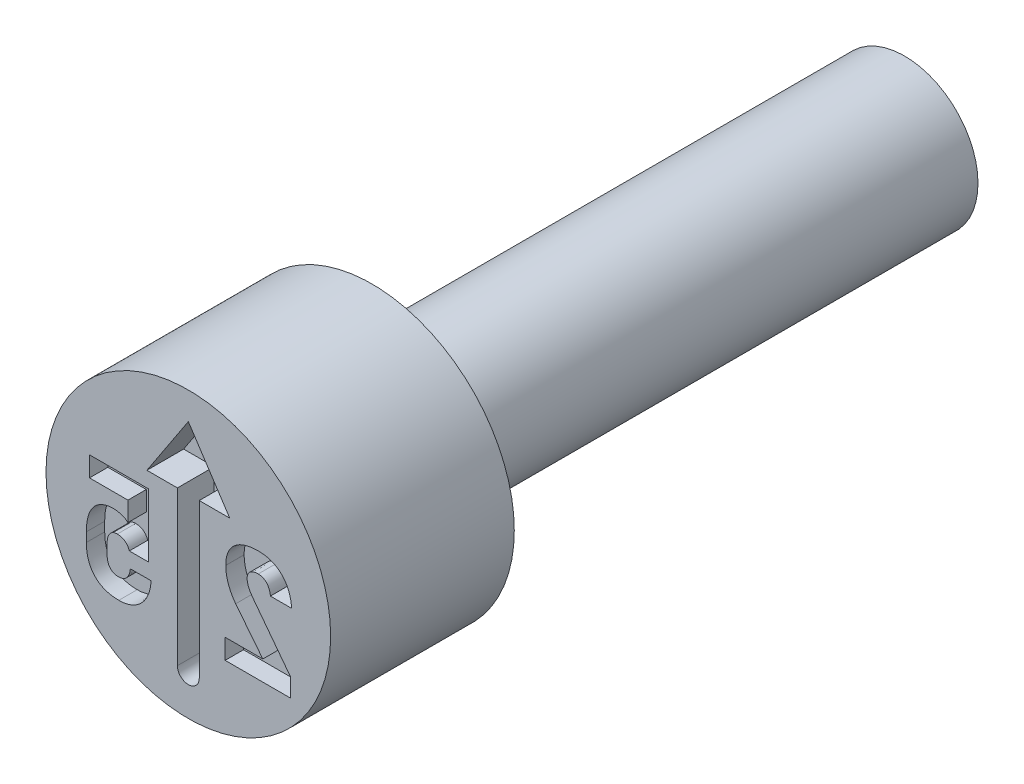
from build123d import *

# Parameters (mm, degrees)
CUT_EXTRUDE4_DEPTH = 0.4
CUT_EXTRUDE5_DEPTH = 0.2


with BuildPart() as part:
    # Sketch2 → Revolve1 (revolve)
    with BuildSketch(Plane(origin=(0, 0, 0), x_dir=(0, 0, -1), z_dir=(1, 0, 0)), mode=Mode.PRIVATE) as revolve1_sk:
        Polygon((0, 1.55), (0, 0), (7.8, 0), (7.8, 0.8), (2, 0.8), (2, 1.55), align=None)
    revolve(revolve1_sk.sketch.rotate(Axis((0, 0, -0.403888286), (0, 0, -1)), 90), axis=Axis((0, 0, -0.403888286), (0, 0, -1)))

    # Sketch3 → Cut-Extrude4 (cut)
    with BuildSketch(Plane.XY):
        with BuildLine():
            Line((0.119045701, 0.566469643), (0.119045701, -1.110101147))
            ThreePointArc((0.119045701, -1.110101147), (0, -1.229146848), (-0.119045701, -1.110101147))
            Line((-0.119045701, -1.110101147), (-0.119045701, 0.566469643))
            Line((-0.119045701, 0.566469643), (-0.451198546, 0.566469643))
            Line((-0.451198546, 0.566469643), (0, 1.251322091))
            Line((0, 1.251322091), (0.451198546, 0.566469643))
            Line((0.451198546, 0.566469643), (0.119045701, 0.566469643))
        make_face()
    extrude(amount=-CUT_EXTRUDE4_DEPTH, mode=Mode.SUBTRACT)

    # Sketch4 → Cut-Extrude5 (cut)
    with BuildSketch(Plane.XY):
        with BuildLine():
            Line((1.11073976, -0.596046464), (0.69891991, -0.054615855))
            add(Edge.make_bspline(
                [(0.69891991, -0.054615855), (0.69028293, -0.042632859), (0.673421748, -0.019239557), (0.6583362, 0.013026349), (0.648752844, 0.038326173), (0.644322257, 0.056678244), (0.641042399, 0.074226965), (0.640660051, 0.085740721), (0.640472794, 0.091379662)],
                knots=[0, 0, 0, 0, 1.660423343, 3.241491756, 3.993801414, 4.704207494, 5.365376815, 6, 6, 6, 6], degree=3))
            Line((0.640472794, 0.091379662), (0.640472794, 0.093091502))
            add(Edge.make_bspline(
                [(0.640472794, 0.093091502), (0.640800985, 0.100797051), (0.641426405, 0.115481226), (0.647464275, 0.136140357), (0.657448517, 0.15400486), (0.671433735, 0.168980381), (0.689223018, 0.18048976), (0.710206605, 0.188897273), (0.734496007, 0.193654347), (0.751721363, 0.194260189), (0.760790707, 0.194579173)],
                knots=[0, 0, 0, 0, 1.033361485, 1.969238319, 2.861873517, 3.760870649, 4.693536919, 5.686153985, 6.781734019, 8, 8, 8, 8], degree=3))
            add(Edge.make_bspline(
                [(0.760790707, 0.194579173), (0.769721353, 0.194201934), (0.787052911, 0.193469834), (0.811707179, 0.186493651), (0.8336084, 0.174650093), (0.85256745, 0.158282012), (0.868475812, 0.137690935), (0.880201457, 0.112885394), (0.889644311, 0.08469284), (0.892384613, 0.064231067), (0.893825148, 0.053474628)],
                knots=[0, 0, 0, 0, 0.993701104, 1.928459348, 2.826878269, 3.748294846, 4.700551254, 5.70417143, 6.793118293, 8, 8, 8, 8], degree=3))
            Line((0.893825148, 0.053474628), (1.125657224, 0.052496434))
            add(Edge.make_bspline(
                [(1.125657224, 0.052496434), (1.123996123, 0.071540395), (1.120760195, 0.106733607), (1.109757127, 0.157344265), (1.093502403, 0.203913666), (1.072734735, 0.246570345), (1.047269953, 0.284775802), (1.01772323, 0.318519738), (0.983767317, 0.347146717), (0.945990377, 0.370934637), (0.904557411, 0.389551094), (0.859975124, 0.403115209), (0.812176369, 0.41093477), (0.779323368, 0.411951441), (0.762502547, 0.412471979)],
                knots=[0, 0, 0, 0, 1.143950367, 2.228484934, 3.258162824, 4.249580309, 5.213917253, 6.146796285, 7.070112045, 8.006232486, 8.954636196, 9.927630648, 10.9389416, 12, 12, 12, 12], degree=3))
            add(Edge.make_bspline(
                [(0.762502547, 0.412471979), (0.744465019, 0.4120949), (0.709554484, 0.411365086), (0.65928566, 0.404494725), (0.613062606, 0.393061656), (0.571001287, 0.376998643), (0.533377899, 0.356350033), (0.50001832, 0.331840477), (0.471864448, 0.302518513), (0.448445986, 0.269208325), (0.429985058, 0.232038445), (0.417056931, 0.191040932), (0.409139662, 0.146545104), (0.408164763, 0.115623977), (0.407662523, 0.099694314)],
                knots=[0, 0, 0, 0, 1.208591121, 2.339154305, 3.392741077, 4.394302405, 5.348037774, 6.261656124, 7.158186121, 8.060194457, 8.981460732, 9.928425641, 10.932785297, 12, 12, 12, 12], degree=3))
            add(Edge.make_bspline(
                [(0.407662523, 0.099694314), (0.407976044, 0.085085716), (0.408603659, 0.057800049), (0.414201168, 0.017036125), (0.423353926, -0.023492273), (0.435772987, -0.063643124), (0.451280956, -0.102745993), (0.469788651, -0.140177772), (0.490918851, -0.175842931), (0.507476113, -0.19789987), (0.515753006, -0.208926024)],
                knots=[0, 0, 0, 0, 0.985191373, 1.972179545, 2.968870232, 3.986806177, 5.007996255, 6.007036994, 7.003727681, 8, 8, 8, 8], degree=3))
            Line((0.515753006, -0.208926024), (0.81116772, -0.582107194))
            Line((0.81116772, -0.582107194), (0.401059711, -0.582107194))
            Line((0.401059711, -0.582107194), (0.401059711, -0.8))
            Line((0.401059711, -0.8), (1.11073976, -0.8))
            Line((1.11073976, -0.8), (1.11073976, -0.596046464))
        make_face()
        with BuildLine():
            add(Edge.make_bspline(
                [(-0.75682902, -0.812471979), (-0.741057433, -0.811990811), (-0.710195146, -0.811049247), (-0.665208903, -0.8025966), (-0.622560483, -0.789506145), (-0.582567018, -0.77083172), (-0.545663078, -0.74710642), (-0.512664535, -0.718094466), (-0.483268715, -0.684555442), (-0.458065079, -0.646195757), (-0.437308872, -0.603425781), (-0.421149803, -0.556749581), (-0.41005112, -0.506251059), (-0.406824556, -0.471216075), (-0.405168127, -0.453230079)],
                knots=[0, 0, 0, 0, 1.013165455, 1.982590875, 2.932437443, 3.87502652, 4.811241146, 5.743574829, 6.690699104, 7.67044025, 8.68537997, 9.739549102, 10.839546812, 12, 12, 12, 12], degree=3))
            Line((-0.405168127, -0.453230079), (-0.631375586, -0.452496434))
            add(Edge.make_bspline(
                [(-0.631375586, -0.452496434), (-0.63266694, -0.463733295), (-0.635127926, -0.483749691), (-0.644002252, -0.511526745), (-0.65558826, -0.535942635), (-0.670892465, -0.556429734), (-0.689066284, -0.57306234), (-0.710601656, -0.584342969), (-0.734402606, -0.591870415), (-0.751306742, -0.592528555), (-0.760008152, -0.592867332)],
                knots=[0, 0, 0, 0, 1.202223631, 2.291125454, 3.30376979, 4.265156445, 5.185306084, 6.082185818, 7.012804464, 8, 8, 8, 8], degree=3))
            add(Edge.make_bspline(
                [(-0.760008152, -0.592867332), (-0.769439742, -0.592456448), (-0.78747993, -0.591670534), (-0.812766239, -0.58408531), (-0.834778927, -0.571941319), (-0.852961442, -0.55446673), (-0.867466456, -0.532693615), (-0.877733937, -0.50662024), (-0.883814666, -0.476660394), (-0.884413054, -0.455380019), (-0.88472794, -0.444181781)],
                knots=[0, 0, 0, 0, 1.026088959, 1.96264217, 2.850204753, 3.743092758, 4.68486217, 5.681854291, 6.780136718, 8, 8, 8, 8], degree=3))
            Line((-0.88472794, -0.444181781), (-0.88472794, -0.343672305))
            add(Edge.make_bspline(
                [(-0.88472794, -0.343672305), (-0.884486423, -0.332474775), (-0.884028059, -0.311223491), (-0.878326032, -0.281496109), (-0.869460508, -0.255559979), (-0.856367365, -0.234029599), (-0.840091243, -0.216651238), (-0.820395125, -0.204308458), (-0.797674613, -0.19701866), (-0.781583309, -0.196164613), (-0.773213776, -0.195720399)],
                knots=[0, 0, 0, 0, 1.281587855, 2.432267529, 3.454745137, 4.406485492, 5.298532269, 6.159104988, 7.042499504, 8, 8, 8, 8], degree=3))
            add(Edge.make_bspline(
                [(-0.773213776, -0.195720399), (-0.765362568, -0.195959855), (-0.750162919, -0.196423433), (-0.728277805, -0.201223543), (-0.708163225, -0.209077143), (-0.69004752, -0.220180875), (-0.6740474, -0.233789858), (-0.660874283, -0.250233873), (-0.649831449, -0.2688147), (-0.645223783, -0.282750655), (-0.64286937, -0.289871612)],
                knots=[0, 0, 0, 0, 1.085085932, 2.100686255, 3.083167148, 4.060192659, 5.028057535, 5.974180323, 6.964852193, 8, 8, 8, 8], degree=3))
            Line((-0.64286937, -0.289871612), (-0.431579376, -0.289871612))
            Line((-0.431579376, -0.289871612), (-0.431579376, 0.4))
            Line((-0.431579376, 0.4), (-1.076209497, 0.4))
            Line((-1.076209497, 0.4), (-1.076209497, 0.182107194))
            Line((-1.076209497, 0.182107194), (-0.657786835, 0.182107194))
            Line((-0.657786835, 0.182107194), (-0.657786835, -0.029916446))
            add(Edge.make_bspline(
                [(-0.657786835, -0.029916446), (-0.662339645, -0.025885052), (-0.67170513, -0.017592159), (-0.688078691, -0.007062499), (-0.706805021, 0.001880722), (-0.734437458, 0.012180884), (-0.770786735, 0.021340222), (-0.800626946, 0.022882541), (-0.815276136, 0.023639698)],
                knots=[0, 0, 0, 0, 0.643749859, 1.324243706, 2.054464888, 2.839075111, 4.448235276, 6, 6, 6, 6], degree=3))
            add(Edge.make_bspline(
                [(-0.815276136, 0.023639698), (-0.830315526, 0.023163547), (-0.859484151, 0.022240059), (-0.901557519, 0.013933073), (-0.940332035, 0.000624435), (-0.975487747, -0.018549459), (-1.00706442, -0.042581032), (-1.034491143, -0.071945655), (-1.057938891, -0.106164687), (-1.077128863, -0.145261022), (-1.092232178, -0.188892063), (-1.103202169, -0.236753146), (-1.109453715, -0.288890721), (-1.110268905, -0.324988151), (-1.11069085, -0.343672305)],
                knots=[0, 0, 0, 0, 1.012739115, 1.964189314, 2.878178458, 3.765675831, 4.65138573, 5.541464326, 6.461953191, 7.437418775, 8.467828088, 9.567356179, 10.740855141, 12, 12, 12, 12], degree=3))
            Line((-1.11069085, -0.343672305), (-1.11069085, -0.444181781))
            add(Edge.make_bspline(
                [(-1.11069085, -0.444181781), (-1.11015515, -0.462871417), (-1.109118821, -0.499027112), (-1.101707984, -0.551310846), (-1.088348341, -0.599270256), (-1.070448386, -0.643215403), (-1.047074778, -0.682273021), (-1.019086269, -0.716773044), (-0.985972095, -0.745918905), (-0.948513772, -0.770447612), (-0.906354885, -0.789259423), (-0.860169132, -0.802925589), (-0.809773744, -0.811054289), (-0.774874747, -0.811988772), (-0.75682902, -0.812471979)],
                knots=[0, 0, 0, 0, 1.159103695, 2.242322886, 3.265299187, 4.239894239, 5.17631577, 6.078070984, 6.98412447, 7.901225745, 8.844758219, 9.836512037, 10.881294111, 12, 12, 12, 12], degree=3))
        make_face()
    extrude(amount=-CUT_EXTRUDE5_DEPTH, mode=Mode.SUBTRACT)


solid = part.part
